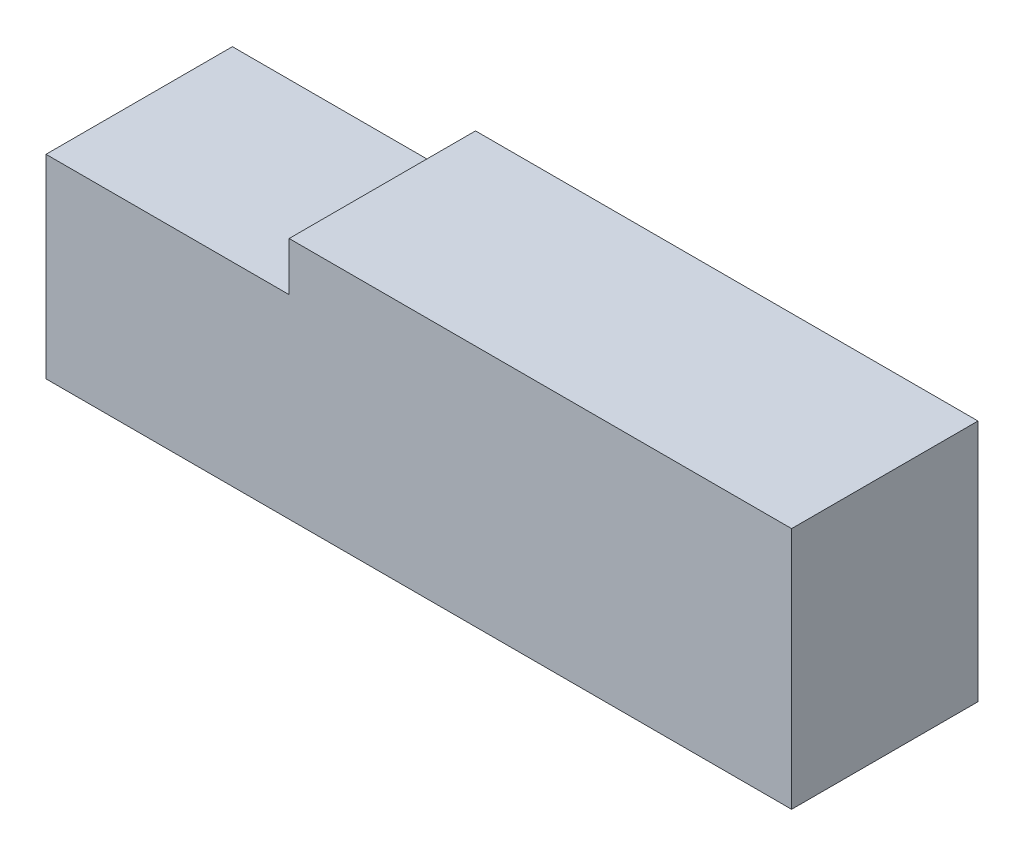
from build123d import *

# Parameters (mm, degrees)
SKETCH1_W           = 230
SKETCH1_H           = 57.5
BOSS_EXTRUDE1_DEPTH = 37.5
SKETCH2_W           = 75
SKETCH2_H           = 57.5
CUT_EXTRUDE1_DEPTH  = 15


with BuildPart() as part:
    # Sketch1 → Boss-Extrude1 (new, symmetric)
    with BuildSketch(Plane(origin=(0, 0, 0), x_dir=(1, 0, 0), z_dir=(0, 1, 0))):
        Rectangle(SKETCH1_W, SKETCH1_H)
    extrude(amount=BOSS_EXTRUDE1_DEPTH, both=True)

    # Sketch2 → Cut-Extrude1 (cut)
    with BuildSketch(Plane(origin=(0, 37.5, 0), x_dir=(1, 0, 0), z_dir=(0, 1, 0))):
        with Locations((-77.5, 0)):
            Rectangle(SKETCH2_W, SKETCH2_H)
    extrude(amount=-CUT_EXTRUDE1_DEPTH, mode=Mode.SUBTRACT)


solid = part.part
